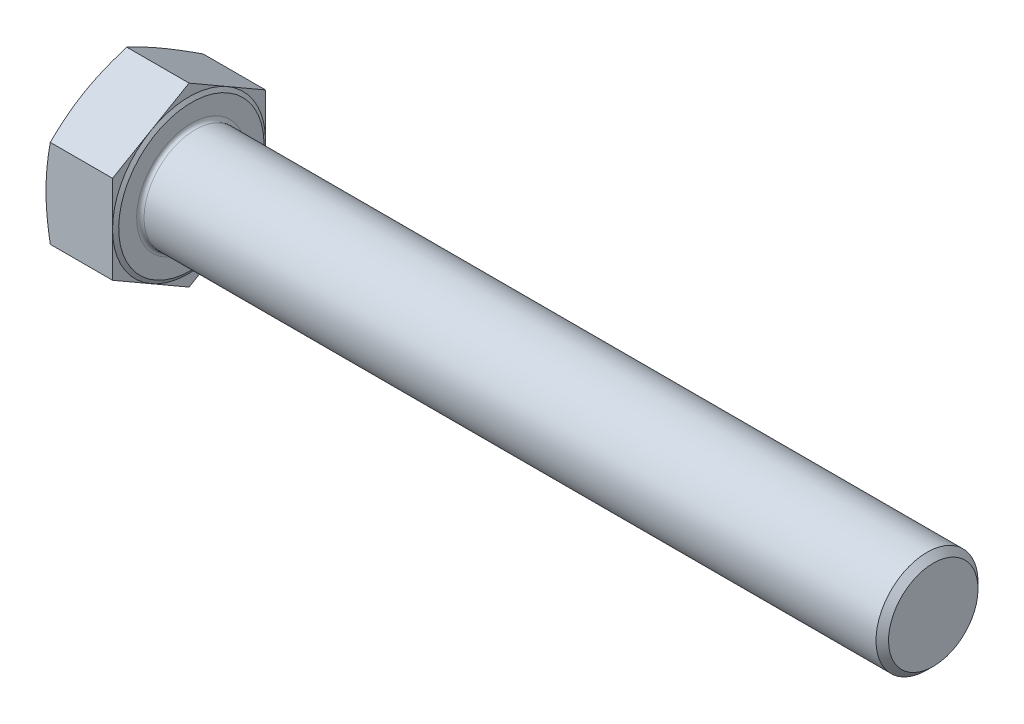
from build123d import *

# Parameters (mm, degrees)
BASEHEAD_DEPTH = 14.35
SKETCH3_R      = 11
BASEBODY_DEPTH = 160
CHAMFER1_SIZE  = 1.353
HEADFILLET_R   = 0.8


with BuildPart() as part:
    # Sketch-BaseHead → BaseHead (new body)
    with BuildSketch(Plane(origin=(0, 0, 0), x_dir=(0, 0, -1), z_dir=(1, 0, 0))):
        Polygon((0, -19.052558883), (16.5, -9.526279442), (16.5, 9.526279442), (0, 19.052558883), (-16.5, 9.526279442), (-16.5, -9.526279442), align=None)
    extrude(amount=BASEHEAD_DEPTH)

    # Sketch4 → HeadChamfer (revolve, cut)
    with BuildSketch(Plane(origin=(-0.264637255, -5.916896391, 0), x_dir=(0, 1, 0), z_dir=(0, 0, 1))):
        Polygon((24.969455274, -0.264637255), (22.416896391, -0.264637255), (24.969455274, -1.19369271), align=None)
    revolve(axis=Axis((-4.001564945, 0, 0), (1, 0, 0)), mode=Mode.SUBTRACT)

    # Sketch1 → Revolve1 (revolve)
    with BuildSketch(Plane(origin=(0, 0, 0), x_dir=(1, 0, 0), z_dir=(0, 1, 0)), mode=Mode.PRIVATE) as revolve1_sk:
        Polygon((14.35, 0), (14.85, 0), (14.85, 15.675), (14.35, 16.5), align=None)
    revolve(revolve1_sk.sketch.rotate(Axis((-4.001564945, 0, 0), (1, 0, 0)), 270), axis=Axis((-4.001564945, 0, 0), (1, 0, 0)))

    # Sketch3 → BaseBody (add)
    with BuildSketch(Plane(origin=(14.85, 0, 0), x_dir=(0, 0, -1), z_dir=(1, 0, 0))):
        with Locations(Location((0, 0, 0), (0, 0, 270))):
            Circle(SKETCH3_R)
    extrude(amount=BASEBODY_DEPTH)

    # Chamfer1
    chamfer1_edges = [part.edges().sort_by_distance(p)[0] for p in [
        (174.85, 11, 0),
    ]]
    chamfer(chamfer1_edges, length=CHAMFER1_SIZE)

    # HeadFillet
    headfillet_edges = [part.edges().sort_by_distance(p)[0] for p in [
        (14.85, 11, 0),
    ]]
    fillet(headfillet_edges, radius=HEADFILLET_R)


solid = part.part
